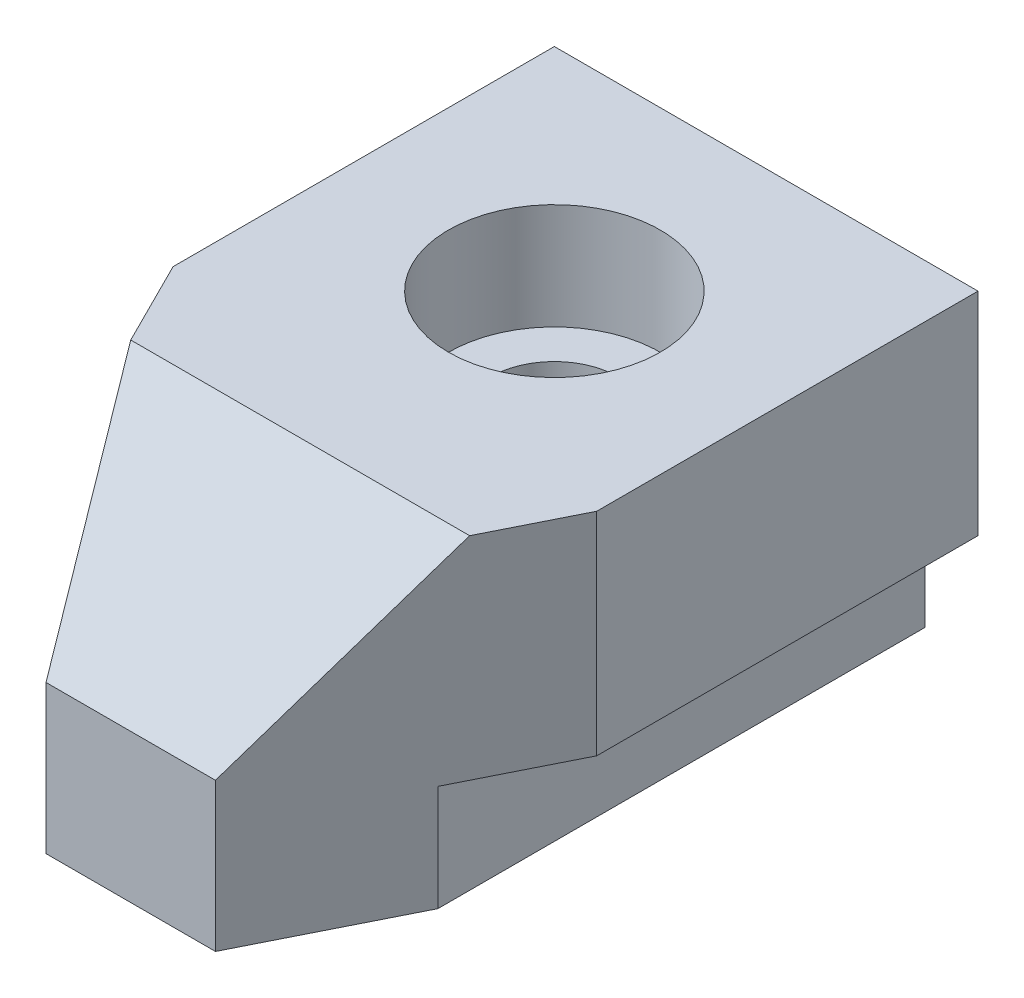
ISO-10303-21;
HEADER;
FILE_DESCRIPTION(('STEP AP214'),'2;1');
FILE_NAME('part.step','',(''),(''),'','','');
FILE_SCHEMA(('AUTOMOTIVE_DESIGN { 1 0 10303 214 1 1 1 1 }'));
ENDSEC;
DATA;
#1=APPLICATION_CONTEXT('core data for automotive mechanical design processes');
#2=APPLICATION_PROTOCOL_DEFINITION('international standard','automotive_design',2000,#1);
#3=PRODUCT_CONTEXT('',#1,'mechanical');
#4=PRODUCT('Part','Part','',(#3));
#5=PRODUCT_RELATED_PRODUCT_CATEGORY('part','',(#4));
#6=PRODUCT_DEFINITION_FORMATION('','',#4);
#7=PRODUCT_DEFINITION_CONTEXT('part definition',#1,'design');
#8=PRODUCT_DEFINITION('design','',#6,#7);
#9=PRODUCT_DEFINITION_SHAPE('','',#8);
#10=(LENGTH_UNIT() NAMED_UNIT(*) SI_UNIT(.MILLI.,.METRE.));
#11=(NAMED_UNIT(*) PLANE_ANGLE_UNIT() SI_UNIT($,.RADIAN.));
#12=(NAMED_UNIT(*) SI_UNIT($,.STERADIAN.) SOLID_ANGLE_UNIT());
#13=UNCERTAINTY_MEASURE_WITH_UNIT(LENGTH_MEASURE(1.E-05),#10,'distance_accuracy_value','');
#14=(GEOMETRIC_REPRESENTATION_CONTEXT(3) GLOBAL_UNCERTAINTY_ASSIGNED_CONTEXT((#13)) GLOBAL_UNIT_ASSIGNED_CONTEXT((#10,
#11,#12)) REPRESENTATION_CONTEXT('',''));
#15=CARTESIAN_POINT('',(0.,0.,0.));
#16=DIRECTION('',(0.,0.,1.));
#17=DIRECTION('',(1.,0.,0.));
#18=AXIS2_PLACEMENT_3D('',#15,#16,#17);
#19=CARTESIAN_POINT('',(20.,-7.5,-15.));
#20=DIRECTION('',(0.,0.,1.));
#21=DIRECTION('',(1.,0.,0.));
#22=AXIS2_PLACEMENT_3D('',#19,#20,#21);
#23=PLANE('',#22);
#24=DIRECTION('',(-1.,0.,0.));
#25=VECTOR('',#24,1.);
#26=CARTESIAN_POINT('',(20.,-2.5,-15.));
#27=LINE('',#26,#25);
#28=CARTESIAN_POINT('',(20.,-2.5,-15.));
#29=VERTEX_POINT('',#28);
#30=CARTESIAN_POINT('',(17.5,-2.5,-15.));
#31=VERTEX_POINT('',#30);
#32=EDGE_CURVE('E125',#29,#31,#27,.T.);
#33=ORIENTED_EDGE('',*,*,#32,.T.);
#34=DIRECTION('',(0.,-1.,0.));
#35=VECTOR('',#34,1.);
#36=CARTESIAN_POINT('',(17.5,-2.5,-15.));
#37=LINE('',#36,#35);
#38=CARTESIAN_POINT('',(17.5,-7.5,-15.));
#39=VERTEX_POINT('',#38);
#40=EDGE_CURVE('E120',#31,#39,#37,.T.);
#41=ORIENTED_EDGE('',*,*,#40,.T.);
#42=DIRECTION('',(-1.,0.,0.));
#43=VECTOR('',#42,1.);
#44=CARTESIAN_POINT('',(20.,-7.5,-15.));
#45=LINE('',#44,#43);
#46=CARTESIAN_POINT('',(2.5,-7.5,-15.));
#47=VERTEX_POINT('',#46);
#48=EDGE_CURVE('E129',#39,#47,#45,.T.);
#49=ORIENTED_EDGE('',*,*,#48,.T.);
#50=DIRECTION('',(0.,1.,0.));
#51=VECTOR('',#50,1.);
#52=CARTESIAN_POINT('',(2.5,-2.5,-15.));
#53=LINE('',#52,#51);
#54=CARTESIAN_POINT('',(2.5,-2.5,-15.));
#55=VERTEX_POINT('',#54);
#56=EDGE_CURVE('E240',#47,#55,#53,.T.);
#57=ORIENTED_EDGE('',*,*,#56,.T.);
#58=DIRECTION('',(-1.,0.,0.));
#59=VECTOR('',#58,1.);
#60=CARTESIAN_POINT('',(0.,-2.5,-15.));
#61=LINE('',#60,#59);
#62=CARTESIAN_POINT('',(0.,-2.5,-15.));
#63=VERTEX_POINT('',#62);
#64=EDGE_CURVE('E236',#55,#63,#61,.T.);
#65=ORIENTED_EDGE('',*,*,#64,.T.);
#66=DIRECTION('',(0.,1.,0.));
#67=VECTOR('',#66,1.);
#68=CARTESIAN_POINT('',(0.,-7.5,-15.));
#69=LINE('',#68,#67);
#70=CARTESIAN_POINT('',(0.,7.5,-15.));
#71=VERTEX_POINT('',#70);
#72=EDGE_CURVE('E205',#63,#71,#69,.T.);
#73=ORIENTED_EDGE('',*,*,#72,.T.);
#74=DIRECTION('',(-1.,0.,0.));
#75=VECTOR('',#74,1.);
#76=CARTESIAN_POINT('',(20.,7.5,-15.));
#77=LINE('',#76,#75);
#78=CARTESIAN_POINT('',(20.,7.5,-15.));
#79=VERTEX_POINT('',#78);
#80=EDGE_CURVE('E137',#79,#71,#77,.T.);
#81=ORIENTED_EDGE('',*,*,#80,.F.);
#82=DIRECTION('',(0.,1.,0.));
#83=VECTOR('',#82,1.);
#84=CARTESIAN_POINT('',(20.,-7.5,-15.));
#85=LINE('',#84,#83);
#86=EDGE_CURVE('E140',#29,#79,#85,.T.);
#87=ORIENTED_EDGE('',*,*,#86,.F.);
#88=EDGE_LOOP('',(#33,#41,#49,#57,#65,#73,#81,#87));
#89=FACE_BOUND('',#88,.T.);
#90=ADVANCED_FACE('F33',(#89),#23,.F.);
#91=CARTESIAN_POINT('',(20.,7.5,15.));
#92=DIRECTION('',(0.,-1.,0.));
#93=DIRECTION('',(0.,0.,-1.));
#94=AXIS2_PLACEMENT_3D('',#91,#92,#93);
#95=PLANE('',#94);
#96=CARTESIAN_POINT('',(10.,7.5,-5.));
#97=DIRECTION('',(0.,1.,0.));
#98=DIRECTION('',(0.,0.,1.));
#99=AXIS2_PLACEMENT_3D('',#96,#97,#98);
#100=CIRCLE('',#99,5.);
#101=CARTESIAN_POINT('',(10.,7.5,0.));
#102=VERTEX_POINT('',#101);
#103=EDGE_CURVE('E191',#102,#102,#100,.T.);
#104=ORIENTED_EDGE('',*,*,#103,.F.);
#105=EDGE_LOOP('',(#104));
#106=FACE_BOUND('',#105,.T.);
#107=DIRECTION('',(1.,0.,0.));
#108=VECTOR('',#107,1.);
#109=CARTESIAN_POINT('',(0.,7.5,7.));
#110=LINE('',#109,#108);
#111=CARTESIAN_POINT('',(2.,7.5,7.));
#112=VERTEX_POINT('',#111);
#113=CARTESIAN_POINT('',(18.,7.5,7.));
#114=VERTEX_POINT('',#113);
#115=EDGE_CURVE('E188',#112,#114,#110,.T.);
#116=ORIENTED_EDGE('',*,*,#115,.T.);
#117=DIRECTION('',(0.447213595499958,0.,-0.894427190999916));
#118=VECTOR('',#117,1.);
#119=CARTESIAN_POINT('',(15.2,7.5,12.6));
#120=LINE('',#119,#118);
#121=CARTESIAN_POINT('',(20.,7.5,3.));
#122=VERTEX_POINT('',#121);
#123=EDGE_CURVE('E166',#114,#122,#120,.T.);
#124=ORIENTED_EDGE('',*,*,#123,.T.);
#125=DIRECTION('',(0.,0.,1.));
#126=VECTOR('',#125,1.);
#127=CARTESIAN_POINT('',(20.,7.5,15.));
#128=LINE('',#127,#126);
#129=EDGE_CURVE('E135',#79,#122,#128,.T.);
#130=ORIENTED_EDGE('',*,*,#129,.F.);
#131=ORIENTED_EDGE('',*,*,#80,.T.);
#132=DIRECTION('',(0.,0.,1.));
#133=VECTOR('',#132,1.);
#134=CARTESIAN_POINT('',(0.,7.5,15.));
#135=LINE('',#134,#133);
#136=CARTESIAN_POINT('',(0.,7.5,3.));
#137=VERTEX_POINT('',#136);
#138=EDGE_CURVE('E143',#71,#137,#135,.T.);
#139=ORIENTED_EDGE('',*,*,#138,.T.);
#140=DIRECTION('',(0.447213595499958,0.,0.894427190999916));
#141=VECTOR('',#140,1.);
#142=CARTESIAN_POINT('',(8.8,7.5,20.6));
#143=LINE('',#142,#141);
#144=EDGE_CURVE('E181',#137,#112,#143,.T.);
#145=ORIENTED_EDGE('',*,*,#144,.T.);
#146=EDGE_LOOP('',(#116,#124,#130,#131,#139,#145));
#147=FACE_BOUND('',#146,.T.);
#148=ADVANCED_FACE('F212',(#106,#147),#95,.F.);
#149=CARTESIAN_POINT('',(20.,-7.5,15.));
#150=DIRECTION('',(0.,0.,-1.));
#151=DIRECTION('',(-1.,0.,0.));
#152=AXIS2_PLACEMENT_3D('',#149,#150,#151);
#153=PLANE('',#152);
#154=DIRECTION('',(-1.,0.,0.));
#155=VECTOR('',#154,1.);
#156=CARTESIAN_POINT('',(20.,-7.5,15.));
#157=LINE('',#156,#155);
#158=CARTESIAN_POINT('',(14.,-7.5,15.));
#159=VERTEX_POINT('',#158);
#160=CARTESIAN_POINT('',(6.,-7.5,15.));
#161=VERTEX_POINT('',#160);
#162=EDGE_CURVE('E134',#159,#161,#157,.T.);
#163=ORIENTED_EDGE('',*,*,#162,.F.);
#164=DIRECTION('',(0.,1.,0.));
#165=VECTOR('',#164,1.);
#166=CARTESIAN_POINT('',(14.,-10.,15.));
#167=LINE('',#166,#165);
#168=CARTESIAN_POINT('',(14.,-0.5,15.));
#169=VERTEX_POINT('',#168);
#170=EDGE_CURVE('E167',#159,#169,#167,.T.);
#171=ORIENTED_EDGE('',*,*,#170,.T.);
#172=DIRECTION('',(1.,0.,0.));
#173=VECTOR('',#172,1.);
#174=CARTESIAN_POINT('',(0.,-0.5,15.));
#175=LINE('',#174,#173);
#176=CARTESIAN_POINT('',(6.,-0.5,15.));
#177=VERTEX_POINT('',#176);
#178=EDGE_CURVE('E187',#177,#169,#175,.T.);
#179=ORIENTED_EDGE('',*,*,#178,.F.);
#180=DIRECTION('',(0.,1.,0.));
#181=VECTOR('',#180,1.);
#182=CARTESIAN_POINT('',(6.,-10.,15.));
#183=LINE('',#182,#181);
#184=EDGE_CURVE('E178',#161,#177,#183,.T.);
#185=ORIENTED_EDGE('',*,*,#184,.F.);
#186=EDGE_LOOP('',(#163,#171,#179,#185));
#187=FACE_BOUND('',#186,.T.);
#188=ADVANCED_FACE('F228',(#187),#153,.F.);
#189=CARTESIAN_POINT('',(20.,-7.5,15.));
#190=DIRECTION('',(0.,1.,0.));
#191=DIRECTION('',(0.,0.,1.));
#192=AXIS2_PLACEMENT_3D('',#189,#190,#191);
#193=PLANE('',#192);
#194=CARTESIAN_POINT('',(10.,-7.5,-5.));
#195=DIRECTION('',(0.,1.,0.));
#196=DIRECTION('',(0.,0.,1.));
#197=AXIS2_PLACEMENT_3D('',#194,#195,#196);
#198=CIRCLE('',#197,3.);
#199=CARTESIAN_POINT('',(10.,-7.5,-2.));
#200=VERTEX_POINT('',#199);
#201=EDGE_CURVE('E202',#200,#200,#198,.T.);
#202=ORIENTED_EDGE('',*,*,#201,.T.);
#203=EDGE_LOOP('',(#202));
#204=FACE_BOUND('',#203,.T.);
#205=ORIENTED_EDGE('',*,*,#48,.F.);
#206=DIRECTION('',(0.,0.,1.));
#207=VECTOR('',#206,1.);
#208=CARTESIAN_POINT('',(17.5,-7.5,-15.));
#209=LINE('',#208,#207);
#210=CARTESIAN_POINT('',(17.5,-7.5,7.99999999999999));
#211=VERTEX_POINT('',#210);
#212=EDGE_CURVE('E116',#39,#211,#209,.T.);
#213=ORIENTED_EDGE('',*,*,#212,.T.);
#214=DIRECTION('',(-0.447213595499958,0.,0.894427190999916));
#215=VECTOR('',#214,1.);
#216=CARTESIAN_POINT('',(15.2,-7.5,12.6));
#217=LINE('',#216,#215);
#218=EDGE_CURVE('E169',#211,#159,#217,.T.);
#219=ORIENTED_EDGE('',*,*,#218,.T.);
#220=ORIENTED_EDGE('',*,*,#162,.T.);
#221=DIRECTION('',(-0.447213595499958,0.,-0.894427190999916));
#222=VECTOR('',#221,1.);
#223=CARTESIAN_POINT('',(8.8,-7.5,20.6));
#224=LINE('',#223,#222);
#225=CARTESIAN_POINT('',(2.5,-7.5,8.));
#226=VERTEX_POINT('',#225);
#227=EDGE_CURVE('E185',#161,#226,#224,.T.);
#228=ORIENTED_EDGE('',*,*,#227,.T.);
#229=DIRECTION('',(0.,0.,1.));
#230=VECTOR('',#229,1.);
#231=CARTESIAN_POINT('',(2.5,-7.5,-15.));
#232=LINE('',#231,#230);
#233=EDGE_CURVE('E55',#47,#226,#232,.T.);
#234=ORIENTED_EDGE('',*,*,#233,.F.);
#235=EDGE_LOOP('',(#205,#213,#219,#220,#228,#234));
#236=FACE_BOUND('',#235,.T.);
#237=ADVANCED_FACE('F132',(#204,#236),#193,.F.);
#238=CARTESIAN_POINT('',(20.,7.5,-15.));
#239=DIRECTION('',(-1.,0.,0.));
#240=DIRECTION('',(0.,0.,1.));
#241=AXIS2_PLACEMENT_3D('',#238,#239,#240);
#242=PLANE('',#241);
#243=DIRECTION('',(0.,1.,0.));
#244=VECTOR('',#243,1.);
#245=CARTESIAN_POINT('',(20.,-10.,3.));
#246=LINE('',#245,#244);
#247=CARTESIAN_POINT('',(20.,-2.5,3.));
#248=VERTEX_POINT('',#247);
#249=EDGE_CURVE('E161',#248,#122,#246,.T.);
#250=ORIENTED_EDGE('',*,*,#249,.F.);
#251=DIRECTION('',(0.,0.,1.));
#252=VECTOR('',#251,1.);
#253=CARTESIAN_POINT('',(20.,-2.5,-15.));
#254=LINE('',#253,#252);
#255=EDGE_CURVE('E47',#29,#248,#254,.T.);
#256=ORIENTED_EDGE('',*,*,#255,.F.);
#257=ORIENTED_EDGE('',*,*,#86,.T.);
#258=ORIENTED_EDGE('',*,*,#129,.T.);
#259=EDGE_LOOP('',(#250,#256,#257,#258));
#260=FACE_BOUND('',#259,.T.);
#261=ADVANCED_FACE('F164',(#260),#242,.F.);
#262=CARTESIAN_POINT('',(0.,7.5,-15.));
#263=DIRECTION('',(-1.,0.,0.));
#264=DIRECTION('',(0.,0.,1.));
#265=AXIS2_PLACEMENT_3D('',#262,#263,#264);
#266=PLANE('',#265);
#267=DIRECTION('',(0.,0.,1.));
#268=VECTOR('',#267,1.);
#269=CARTESIAN_POINT('',(0.,-2.5,-15.));
#270=LINE('',#269,#268);
#271=CARTESIAN_POINT('',(0.,-2.5,2.99999999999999));
#272=VERTEX_POINT('',#271);
#273=EDGE_CURVE('E172',#63,#272,#270,.T.);
#274=ORIENTED_EDGE('',*,*,#273,.T.);
#275=DIRECTION('',(0.,1.,0.));
#276=VECTOR('',#275,1.);
#277=CARTESIAN_POINT('',(0.,-10.,3.));
#278=LINE('',#277,#276);
#279=EDGE_CURVE('E179',#272,#137,#278,.T.);
#280=ORIENTED_EDGE('',*,*,#279,.T.);
#281=ORIENTED_EDGE('',*,*,#138,.F.);
#282=ORIENTED_EDGE('',*,*,#72,.F.);
#283=EDGE_LOOP('',(#274,#280,#281,#282));
#284=FACE_BOUND('',#283,.T.);
#285=ADVANCED_FACE('F217',(#284),#266,.T.);
#286=CARTESIAN_POINT('',(10.,10.1510574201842,-5.));
#287=DIRECTION('',(0.,1.,0.));
#288=DIRECTION('',(0.,0.,1.));
#289=AXIS2_PLACEMENT_3D('',#286,#287,#288);
#290=CYLINDRICAL_SURFACE('',#289,3.);
#291=ORIENTED_EDGE('',*,*,#201,.F.);
#292=EDGE_LOOP('',(#291));
#293=FACE_BOUND('',#292,.T.);
#294=CARTESIAN_POINT('',(10.,2.5,-5.));
#295=DIRECTION('',(0.,1.,0.));
#296=DIRECTION('',(0.,0.,1.));
#297=AXIS2_PLACEMENT_3D('',#294,#295,#296);
#298=CIRCLE('',#297,3.);
#299=CARTESIAN_POINT('',(10.,2.5,-2.));
#300=VERTEX_POINT('',#299);
#301=EDGE_CURVE('E199',#300,#300,#298,.T.);
#302=ORIENTED_EDGE('',*,*,#301,.T.);
#303=EDGE_LOOP('',(#302));
#304=FACE_BOUND('',#303,.T.);
#305=ADVANCED_FACE('F268',(#293,#304),#290,.F.);
#306=CARTESIAN_POINT('',(10.,2.5,0.));
#307=DIRECTION('',(0.,-1.,0.));
#308=DIRECTION('',(0.,0.,-1.));
#309=AXIS2_PLACEMENT_3D('',#306,#307,#308);
#310=PLANE('',#309);
#311=ORIENTED_EDGE('',*,*,#301,.F.);
#312=EDGE_LOOP('',(#311));
#313=FACE_BOUND('',#312,.T.);
#314=CARTESIAN_POINT('',(10.,2.5,-5.));
#315=DIRECTION('',(0.,1.,0.));
#316=DIRECTION('',(0.,0.,1.));
#317=AXIS2_PLACEMENT_3D('',#314,#315,#316);
#318=CIRCLE('',#317,5.);
#319=CARTESIAN_POINT('',(10.,2.5,0.));
#320=VERTEX_POINT('',#319);
#321=EDGE_CURVE('E196',#320,#320,#318,.T.);
#322=ORIENTED_EDGE('',*,*,#321,.T.);
#323=EDGE_LOOP('',(#322));
#324=FACE_BOUND('',#323,.T.);
#325=ADVANCED_FACE('F273',(#313,#324),#310,.F.);
#326=CARTESIAN_POINT('',(10.,10.1510574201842,-5.));
#327=DIRECTION('',(0.,1.,0.));
#328=DIRECTION('',(0.,0.,1.));
#329=AXIS2_PLACEMENT_3D('',#326,#327,#328);
#330=CYLINDRICAL_SURFACE('',#329,5.);
#331=ORIENTED_EDGE('',*,*,#321,.F.);
#332=EDGE_LOOP('',(#331));
#333=FACE_BOUND('',#332,.T.);
#334=ORIENTED_EDGE('',*,*,#103,.T.);
#335=EDGE_LOOP('',(#334));
#336=FACE_BOUND('',#335,.T.);
#337=ADVANCED_FACE('F277',(#333,#336),#330,.F.);
#338=CARTESIAN_POINT('',(0.,-0.5,15.));
#339=DIRECTION('',(0.,-0.707106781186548,-0.707106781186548));
#340=DIRECTION('',(0.,0.707106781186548,-0.707106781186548));
#341=AXIS2_PLACEMENT_3D('',#338,#339,#340);
#342=PLANE('',#341);
#343=ORIENTED_EDGE('',*,*,#178,.T.);
#344=DIRECTION('',(0.333333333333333,0.666666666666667,-0.666666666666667));
#345=VECTOR('',#344,1.);
#346=CARTESIAN_POINT('',(12.4444444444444,-3.61111111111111,18.1111111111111));
#347=LINE('',#346,#345);
#348=EDGE_CURVE('E151',#169,#114,#347,.T.);
#349=ORIENTED_EDGE('',*,*,#348,.T.);
#350=ORIENTED_EDGE('',*,*,#115,.F.);
#351=DIRECTION('',(0.333333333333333,-0.666666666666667,0.666666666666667));
#352=VECTOR('',#351,1.);
#353=CARTESIAN_POINT('',(5.33333333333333,0.833333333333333,13.6666666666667));
#354=LINE('',#353,#352);
#355=EDGE_CURVE('E148',#112,#177,#354,.T.);
#356=ORIENTED_EDGE('',*,*,#355,.T.);
#357=EDGE_LOOP('',(#343,#349,#350,#356));
#358=FACE_BOUND('',#357,.T.);
#359=ADVANCED_FACE('F225',(#358),#342,.F.);
#360=CARTESIAN_POINT('',(0.,-10.,3.));
#361=DIRECTION('',(0.894427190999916,0.,-0.447213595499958));
#362=DIRECTION('',(-0.447213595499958,0.,-0.894427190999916));
#363=AXIS2_PLACEMENT_3D('',#360,#361,#362);
#364=PLANE('',#363);
#365=ORIENTED_EDGE('',*,*,#279,.F.);
#366=DIRECTION('',(0.447213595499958,0.,0.894427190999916));
#367=VECTOR('',#366,1.);
#368=CARTESIAN_POINT('',(0.,-2.5,3.));
#369=LINE('',#368,#367);
#370=CARTESIAN_POINT('',(2.5,-2.5,8.));
#371=VERTEX_POINT('',#370);
#372=EDGE_CURVE('E156',#272,#371,#369,.T.);
#373=ORIENTED_EDGE('',*,*,#372,.T.);
#374=DIRECTION('',(0.,-1.,0.));
#375=VECTOR('',#374,1.);
#376=CARTESIAN_POINT('',(2.5,-10.,8.));
#377=LINE('',#376,#375);
#378=EDGE_CURVE('E154',#371,#226,#377,.T.);
#379=ORIENTED_EDGE('',*,*,#378,.T.);
#380=ORIENTED_EDGE('',*,*,#227,.F.);
#381=ORIENTED_EDGE('',*,*,#184,.T.);
#382=ORIENTED_EDGE('',*,*,#355,.F.);
#383=ORIENTED_EDGE('',*,*,#144,.F.);
#384=EDGE_LOOP('',(#365,#373,#379,#380,#381,#382,#383));
#385=FACE_BOUND('',#384,.T.);
#386=ADVANCED_FACE('F220',(#385),#364,.F.);
#387=CARTESIAN_POINT('',(20.,-10.,3.));
#388=DIRECTION('',(-0.894427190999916,0.,-0.447213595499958));
#389=DIRECTION('',(-0.447213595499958,0.,0.894427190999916));
#390=AXIS2_PLACEMENT_3D('',#387,#388,#389);
#391=PLANE('',#390);
#392=ORIENTED_EDGE('',*,*,#218,.F.);
#393=DIRECTION('',(0.,1.,0.));
#394=VECTOR('',#393,1.);
#395=CARTESIAN_POINT('',(17.5,-9.99999999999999,8.00000000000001));
#396=LINE('',#395,#394);
#397=CARTESIAN_POINT('',(17.5,-2.5,7.99999999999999));
#398=VERTEX_POINT('',#397);
#399=EDGE_CURVE('E11',#211,#398,#396,.T.);
#400=ORIENTED_EDGE('',*,*,#399,.T.);
#401=DIRECTION('',(0.447213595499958,0.,-0.894427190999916));
#402=VECTOR('',#401,1.);
#403=CARTESIAN_POINT('',(20.,-2.5,3.));
#404=LINE('',#403,#402);
#405=EDGE_CURVE('E40',#398,#248,#404,.T.);
#406=ORIENTED_EDGE('',*,*,#405,.T.);
#407=ORIENTED_EDGE('',*,*,#249,.T.);
#408=ORIENTED_EDGE('',*,*,#123,.F.);
#409=ORIENTED_EDGE('',*,*,#348,.F.);
#410=ORIENTED_EDGE('',*,*,#170,.F.);
#411=EDGE_LOOP('',(#392,#400,#406,#407,#408,#409,#410));
#412=FACE_BOUND('',#411,.T.);
#413=ADVANCED_FACE('F160',(#412),#391,.F.);
#414=CARTESIAN_POINT('',(0.,-2.5,-15.));
#415=DIRECTION('',(0.,1.,0.));
#416=DIRECTION('',(0.,0.,1.));
#417=AXIS2_PLACEMENT_3D('',#414,#415,#416);
#418=PLANE('',#417);
#419=ORIENTED_EDGE('',*,*,#273,.F.);
#420=ORIENTED_EDGE('',*,*,#64,.F.);
#421=DIRECTION('',(0.,0.,1.));
#422=VECTOR('',#421,1.);
#423=CARTESIAN_POINT('',(2.5,-2.5,-15.));
#424=LINE('',#423,#422);
#425=EDGE_CURVE('E232',#55,#371,#424,.T.);
#426=ORIENTED_EDGE('',*,*,#425,.T.);
#427=ORIENTED_EDGE('',*,*,#372,.F.);
#428=EDGE_LOOP('',(#419,#420,#426,#427));
#429=FACE_BOUND('',#428,.T.);
#430=ADVANCED_FACE('F235',(#429),#418,.F.);
#431=CARTESIAN_POINT('',(2.5,-2.5,-15.));
#432=DIRECTION('',(1.,0.,0.));
#433=DIRECTION('',(0.,1.,0.));
#434=AXIS2_PLACEMENT_3D('',#431,#432,#433);
#435=PLANE('',#434);
#436=ORIENTED_EDGE('',*,*,#425,.F.);
#437=ORIENTED_EDGE('',*,*,#56,.F.);
#438=ORIENTED_EDGE('',*,*,#233,.T.);
#439=ORIENTED_EDGE('',*,*,#378,.F.);
#440=EDGE_LOOP('',(#436,#437,#438,#439));
#441=FACE_BOUND('',#440,.T.);
#442=ADVANCED_FACE('F231',(#441),#435,.F.);
#443=CARTESIAN_POINT('',(17.5,-2.5,-15.));
#444=DIRECTION('',(-1.,0.,0.));
#445=DIRECTION('',(0.,-1.,0.));
#446=AXIS2_PLACEMENT_3D('',#443,#444,#445);
#447=PLANE('',#446);
#448=ORIENTED_EDGE('',*,*,#212,.F.);
#449=ORIENTED_EDGE('',*,*,#40,.F.);
#450=DIRECTION('',(0.,0.,1.));
#451=VECTOR('',#450,1.);
#452=CARTESIAN_POINT('',(17.5,-2.5,-15.));
#453=LINE('',#452,#451);
#454=EDGE_CURVE('E241',#31,#398,#453,.T.);
#455=ORIENTED_EDGE('',*,*,#454,.T.);
#456=ORIENTED_EDGE('',*,*,#399,.F.);
#457=EDGE_LOOP('',(#448,#449,#455,#456));
#458=FACE_BOUND('',#457,.T.);
#459=ADVANCED_FACE('F118',(#458),#447,.F.);
#460=CARTESIAN_POINT('',(20.,-2.5,-15.));
#461=DIRECTION('',(0.,1.,0.));
#462=DIRECTION('',(0.,0.,1.));
#463=AXIS2_PLACEMENT_3D('',#460,#461,#462);
#464=PLANE('',#463);
#465=ORIENTED_EDGE('',*,*,#454,.F.);
#466=ORIENTED_EDGE('',*,*,#32,.F.);
#467=ORIENTED_EDGE('',*,*,#255,.T.);
#468=ORIENTED_EDGE('',*,*,#405,.F.);
#469=EDGE_LOOP('',(#465,#466,#467,#468));
#470=FACE_BOUND('',#469,.T.);
#471=ADVANCED_FACE('F245',(#470),#464,.F.);
#472=CLOSED_SHELL('',(#90,#148,#188,#237,#261,#285,#305,#325,#337,#359,#386,#413,#430,#442,#459,#471));
#473=MANIFOLD_SOLID_BREP('B2',#472);
#474=ADVANCED_BREP_SHAPE_REPRESENTATION('',(#18,#473),#14);
#475=SHAPE_DEFINITION_REPRESENTATION(#9,#474);
ENDSEC;
END-ISO-10303-21;
